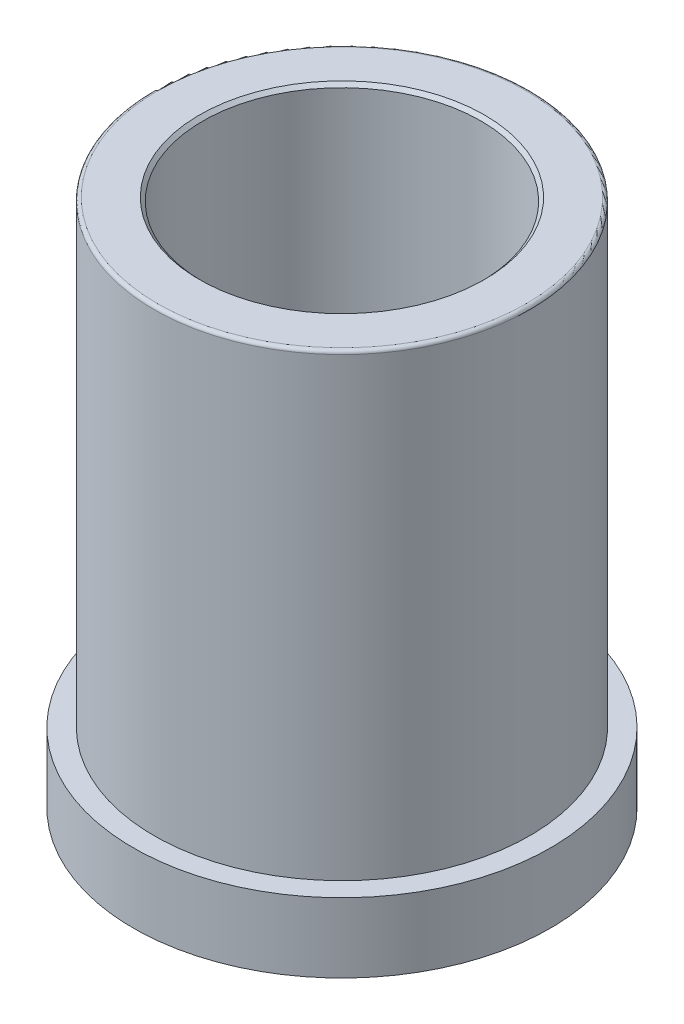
ISO-10303-21;
HEADER;
FILE_DESCRIPTION(('STEP AP214'),'2;1');
FILE_NAME('part.step','',(''),(''),'','','');
FILE_SCHEMA(('AUTOMOTIVE_DESIGN { 1 0 10303 214 1 1 1 1 }'));
ENDSEC;
DATA;
#1=APPLICATION_CONTEXT('core data for automotive mechanical design processes');
#2=APPLICATION_PROTOCOL_DEFINITION('international standard','automotive_design',2000,#1);
#3=PRODUCT_CONTEXT('',#1,'mechanical');
#4=PRODUCT('Part','Part','',(#3));
#5=PRODUCT_RELATED_PRODUCT_CATEGORY('part','',(#4));
#6=PRODUCT_DEFINITION_FORMATION('','',#4);
#7=PRODUCT_DEFINITION_CONTEXT('part definition',#1,'design');
#8=PRODUCT_DEFINITION('design','',#6,#7);
#9=PRODUCT_DEFINITION_SHAPE('','',#8);
#10=(LENGTH_UNIT() NAMED_UNIT(*) SI_UNIT(.MILLI.,.METRE.));
#11=(NAMED_UNIT(*) PLANE_ANGLE_UNIT() SI_UNIT($,.RADIAN.));
#12=(NAMED_UNIT(*) SI_UNIT($,.STERADIAN.) SOLID_ANGLE_UNIT());
#13=UNCERTAINTY_MEASURE_WITH_UNIT(LENGTH_MEASURE(1.E-05),#10,'distance_accuracy_value','');
#14=(GEOMETRIC_REPRESENTATION_CONTEXT(3) GLOBAL_UNCERTAINTY_ASSIGNED_CONTEXT((#13)) GLOBAL_UNIT_ASSIGNED_CONTEXT((#10,
#11,#12)) REPRESENTATION_CONTEXT('',''));
#15=CARTESIAN_POINT('',(0.,0.,0.));
#16=DIRECTION('',(0.,0.,1.));
#17=DIRECTION('',(1.,0.,0.));
#18=AXIS2_PLACEMENT_3D('',#15,#16,#17);
#19=CARTESIAN_POINT('',(0.,0.,0.));
#20=DIRECTION('',(0.,-1.,0.));
#21=DIRECTION('',(0.,0.,-1.));
#22=AXIS2_PLACEMENT_3D('',#19,#20,#21);
#23=CYLINDRICAL_SURFACE('',#22,27.);
#24=CARTESIAN_POINT('',(0.,65.5,0.));
#25=DIRECTION('',(0.,-1.,0.));
#26=DIRECTION('',(0.,0.,-1.));
#27=AXIS2_PLACEMENT_3D('',#24,#25,#26);
#28=CIRCLE('',#27,27.);
#29=CARTESIAN_POINT('',(0.,65.5,-27.));
#30=VERTEX_POINT('',#29);
#31=EDGE_CURVE('E21',#30,#30,#28,.T.);
#32=ORIENTED_EDGE('',*,*,#31,.T.);
#33=EDGE_LOOP('',(#32));
#34=FACE_BOUND('',#33,.T.);
#35=CARTESIAN_POINT('',(0.,0.,0.));
#36=DIRECTION('',(0.,-1.,0.));
#37=DIRECTION('',(0.,0.,-1.));
#38=AXIS2_PLACEMENT_3D('',#35,#36,#37);
#39=CIRCLE('',#38,27.);
#40=CARTESIAN_POINT('',(0.,0.,-27.));
#41=VERTEX_POINT('',#40);
#42=EDGE_CURVE('E49',#41,#41,#39,.T.);
#43=ORIENTED_EDGE('',*,*,#42,.F.);
#44=EDGE_LOOP('',(#43));
#45=FACE_BOUND('',#44,.T.);
#46=ADVANCED_FACE('F14',(#34,#45),#23,.T.);
#47=CARTESIAN_POINT('',(-27.,66.,0.));
#48=DIRECTION('',(0.,-1.,0.));
#49=DIRECTION('',(0.,0.,-1.));
#50=AXIS2_PLACEMENT_3D('',#47,#48,#49);
#51=PLANE('',#50);
#52=CARTESIAN_POINT('',(0.,66.,0.));
#53=DIRECTION('',(0.,-1.,0.));
#54=DIRECTION('',(0.,0.,-1.));
#55=AXIS2_PLACEMENT_3D('',#52,#53,#54);
#56=CIRCLE('',#55,26.5);
#57=CARTESIAN_POINT('',(0.,66.,-26.5));
#58=VERTEX_POINT('',#57);
#59=EDGE_CURVE('E9',#58,#58,#56,.F.);
#60=ORIENTED_EDGE('',*,*,#59,.T.);
#61=EDGE_LOOP('',(#60));
#62=FACE_BOUND('',#61,.T.);
#63=CARTESIAN_POINT('',(0.,66.,0.));
#64=DIRECTION('',(0.,-1.,0.));
#65=DIRECTION('',(0.,0.,-1.));
#66=AXIS2_PLACEMENT_3D('',#63,#64,#65);
#67=CIRCLE('',#66,20.5);
#68=CARTESIAN_POINT('',(0.,66.,-20.5));
#69=VERTEX_POINT('',#68);
#70=EDGE_CURVE('E37',#69,#69,#67,.T.);
#71=ORIENTED_EDGE('',*,*,#70,.T.);
#72=EDGE_LOOP('',(#71));
#73=FACE_BOUND('',#72,.T.);
#74=ADVANCED_FACE('F56',(#62,#73),#51,.F.);
#75=CARTESIAN_POINT('',(0.,0.,0.));
#76=DIRECTION('',(0.,-1.,0.));
#77=DIRECTION('',(0.,0.,-1.));
#78=AXIS2_PLACEMENT_3D('',#75,#76,#77);
#79=CYLINDRICAL_SURFACE('',#78,20.);
#80=CARTESIAN_POINT('',(0.,65.5,0.));
#81=DIRECTION('',(0.,-1.,0.));
#82=DIRECTION('',(0.,0.,-1.));
#83=AXIS2_PLACEMENT_3D('',#80,#81,#82);
#84=CIRCLE('',#83,20.);
#85=CARTESIAN_POINT('',(0.,65.5,-20.));
#86=VERTEX_POINT('',#85);
#87=EDGE_CURVE('E34',#86,#86,#84,.F.);
#88=ORIENTED_EDGE('',*,*,#87,.T.);
#89=EDGE_LOOP('',(#88));
#90=FACE_BOUND('',#89,.T.);
#91=CARTESIAN_POINT('',(0.,-10.,0.));
#92=DIRECTION('',(0.,-1.,0.));
#93=DIRECTION('',(0.,0.,-1.));
#94=AXIS2_PLACEMENT_3D('',#91,#92,#93);
#95=CIRCLE('',#94,20.);
#96=CARTESIAN_POINT('',(0.,-10.,-20.));
#97=VERTEX_POINT('',#96);
#98=EDGE_CURVE('E40',#97,#97,#95,.T.);
#99=ORIENTED_EDGE('',*,*,#98,.T.);
#100=EDGE_LOOP('',(#99));
#101=FACE_BOUND('',#100,.T.);
#102=ADVANCED_FACE('F63',(#90,#101),#79,.F.);
#103=CARTESIAN_POINT('',(0.,-10.15,0.));
#104=DIRECTION('',(0.,-1.,0.));
#105=DIRECTION('',(0.,0.,-1.));
#106=AXIS2_PLACEMENT_3D('',#103,#104,#105);
#107=CONICAL_SURFACE('',#106,20.1,0.588002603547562);
#108=CARTESIAN_POINT('',(0.,-10.36,0.));
#109=DIRECTION('',(0.,1.,0.));
#110=DIRECTION('',(0.,0.,1.));
#111=AXIS2_PLACEMENT_3D('',#108,#109,#110);
#112=CIRCLE('',#111,20.24);
#113=CARTESIAN_POINT('',(0.,-10.36,20.24));
#114=VERTEX_POINT('',#113);
#115=EDGE_CURVE('E25',#114,#114,#112,.F.);
#116=ORIENTED_EDGE('',*,*,#115,.T.);
#117=EDGE_LOOP('',(#116));
#118=FACE_BOUND('',#117,.T.);
#119=ORIENTED_EDGE('',*,*,#98,.F.);
#120=EDGE_LOOP('',(#119));
#121=FACE_BOUND('',#120,.T.);
#122=ADVANCED_FACE('F82',(#118,#121),#107,.F.);
#123=CARTESIAN_POINT('',(-20.1,-10.,0.));
#124=DIRECTION('',(0.,1.,0.));
#125=DIRECTION('',(0.,0.,1.));
#126=AXIS2_PLACEMENT_3D('',#123,#124,#125);
#127=PLANE('',#126);
#128=CARTESIAN_POINT('',(0.,-10.,0.));
#129=DIRECTION('',(0.,1.,0.));
#130=DIRECTION('',(0.,0.,1.));
#131=AXIS2_PLACEMENT_3D('',#128,#129,#130);
#132=CIRCLE('',#131,20.6);
#133=CARTESIAN_POINT('',(0.,-10.,20.6));
#134=VERTEX_POINT('',#133);
#135=EDGE_CURVE('E29',#134,#134,#132,.T.);
#136=ORIENTED_EDGE('',*,*,#135,.T.);
#137=EDGE_LOOP('',(#136));
#138=FACE_BOUND('',#137,.T.);
#139=CARTESIAN_POINT('',(0.,-10.,0.));
#140=DIRECTION('',(0.,-1.,0.));
#141=DIRECTION('',(0.,0.,-1.));
#142=AXIS2_PLACEMENT_3D('',#139,#140,#141);
#143=CIRCLE('',#142,30.);
#144=CARTESIAN_POINT('',(0.,-10.,-30.));
#145=VERTEX_POINT('',#144);
#146=EDGE_CURVE('E43',#145,#145,#143,.T.);
#147=ORIENTED_EDGE('',*,*,#146,.T.);
#148=EDGE_LOOP('',(#147));
#149=FACE_BOUND('',#148,.T.);
#150=ADVANCED_FACE('F85',(#138,#149),#127,.F.);
#151=CARTESIAN_POINT('',(0.,0.,0.));
#152=DIRECTION('',(0.,-1.,0.));
#153=DIRECTION('',(0.,0.,-1.));
#154=AXIS2_PLACEMENT_3D('',#151,#152,#153);
#155=CYLINDRICAL_SURFACE('',#154,30.);
#156=ORIENTED_EDGE('',*,*,#146,.F.);
#157=EDGE_LOOP('',(#156));
#158=FACE_BOUND('',#157,.T.);
#159=CARTESIAN_POINT('',(0.,0.,0.));
#160=DIRECTION('',(0.,-1.,0.));
#161=DIRECTION('',(0.,0.,-1.));
#162=AXIS2_PLACEMENT_3D('',#159,#160,#161);
#163=CIRCLE('',#162,30.);
#164=CARTESIAN_POINT('',(0.,0.,-30.));
#165=VERTEX_POINT('',#164);
#166=EDGE_CURVE('E46',#165,#165,#163,.T.);
#167=ORIENTED_EDGE('',*,*,#166,.T.);
#168=EDGE_LOOP('',(#167));
#169=FACE_BOUND('',#168,.T.);
#170=ADVANCED_FACE('F97',(#158,#169),#155,.T.);
#171=CARTESIAN_POINT('',(-30.,0.,0.));
#172=DIRECTION('',(0.,-1.,0.));
#173=DIRECTION('',(0.,0.,-1.));
#174=AXIS2_PLACEMENT_3D('',#171,#172,#173);
#175=PLANE('',#174);
#176=ORIENTED_EDGE('',*,*,#166,.F.);
#177=EDGE_LOOP('',(#176));
#178=FACE_BOUND('',#177,.T.);
#179=ORIENTED_EDGE('',*,*,#42,.T.);
#180=EDGE_LOOP('',(#179));
#181=FACE_BOUND('',#180,.T.);
#182=ADVANCED_FACE('F53',(#178,#181),#175,.F.);
#183=CARTESIAN_POINT('',(0.,66.,0.));
#184=DIRECTION('',(0.,1.,0.));
#185=DIRECTION('',(0.,0.,1.));
#186=AXIS2_PLACEMENT_3D('',#183,#184,#185);
#187=CONICAL_SURFACE('',#186,20.5,0.785398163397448);
#188=ORIENTED_EDGE('',*,*,#87,.F.);
#189=EDGE_LOOP('',(#188));
#190=FACE_BOUND('',#189,.T.);
#191=ORIENTED_EDGE('',*,*,#70,.F.);
#192=EDGE_LOOP('',(#191));
#193=FACE_BOUND('',#192,.T.);
#194=ADVANCED_FACE('F67',(#190,#193),#187,.F.);
#195=CARTESIAN_POINT('',(0.,-10.5,0.));
#196=DIRECTION('',(0.,1.,0.));
#197=DIRECTION('',(0.,0.,1.));
#198=AXIS2_PLACEMENT_3D('',#195,#196,#197);
#199=CONICAL_SURFACE('',#198,20.1,0.785398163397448);
#200=ORIENTED_EDGE('',*,*,#135,.F.);
#201=EDGE_LOOP('',(#200));
#202=FACE_BOUND('',#201,.T.);
#203=ORIENTED_EDGE('',*,*,#115,.F.);
#204=EDGE_LOOP('',(#203));
#205=FACE_BOUND('',#204,.T.);
#206=ADVANCED_FACE('F69',(#202,#205),#199,.T.);
#207=CARTESIAN_POINT('',(0.,65.5,0.));
#208=DIRECTION('',(0.,-1.,0.));
#209=DIRECTION('',(0.,0.,-1.));
#210=AXIS2_PLACEMENT_3D('',#207,#208,#209);
#211=TOROIDAL_SURFACE('',#210,26.5,0.5);
#212=ORIENTED_EDGE('',*,*,#59,.F.);
#213=EDGE_LOOP('',(#212));
#214=FACE_BOUND('',#213,.T.);
#215=ORIENTED_EDGE('',*,*,#31,.F.);
#216=EDGE_LOOP('',(#215));
#217=FACE_BOUND('',#216,.T.);
#218=ADVANCED_FACE('F16',(#214,#217),#211,.T.);
#219=CLOSED_SHELL('',(#46,#74,#102,#122,#150,#170,#182,#194,#206,#218));
#220=MANIFOLD_SOLID_BREP('B1',#219);
#221=ADVANCED_BREP_SHAPE_REPRESENTATION('',(#18,#220),#14);
#222=SHAPE_DEFINITION_REPRESENTATION(#9,#221);
ENDSEC;
END-ISO-10303-21;
